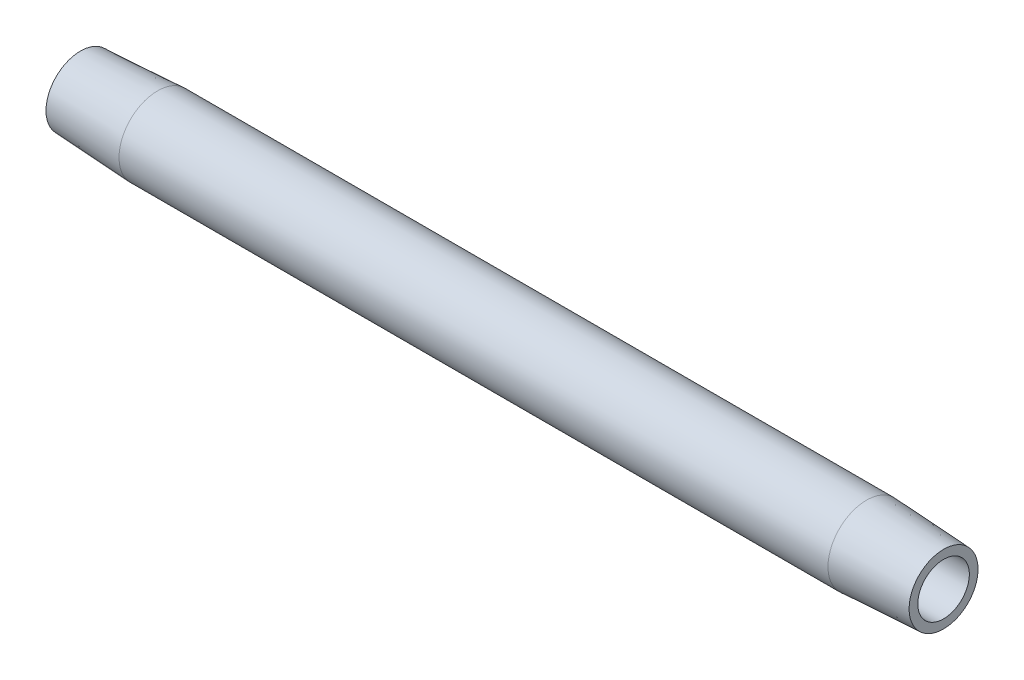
ISO-10303-21;
HEADER;
FILE_DESCRIPTION(('STEP AP214'),'2;1');
FILE_NAME('part.step','',(''),(''),'','','');
FILE_SCHEMA(('AUTOMOTIVE_DESIGN { 1 0 10303 214 1 1 1 1 }'));
ENDSEC;
DATA;
#1=APPLICATION_CONTEXT('core data for automotive mechanical design processes');
#2=APPLICATION_PROTOCOL_DEFINITION('international standard','automotive_design',2000,#1);
#3=PRODUCT_CONTEXT('',#1,'mechanical');
#4=PRODUCT('Part','Part','',(#3));
#5=PRODUCT_RELATED_PRODUCT_CATEGORY('part','',(#4));
#6=PRODUCT_DEFINITION_FORMATION('','',#4);
#7=PRODUCT_DEFINITION_CONTEXT('part definition',#1,'design');
#8=PRODUCT_DEFINITION('design','',#6,#7);
#9=PRODUCT_DEFINITION_SHAPE('','',#8);
#10=(LENGTH_UNIT() NAMED_UNIT(*) SI_UNIT(.MILLI.,.METRE.));
#11=(NAMED_UNIT(*) PLANE_ANGLE_UNIT() SI_UNIT($,.RADIAN.));
#12=(NAMED_UNIT(*) SI_UNIT($,.STERADIAN.) SOLID_ANGLE_UNIT());
#13=UNCERTAINTY_MEASURE_WITH_UNIT(LENGTH_MEASURE(1.E-05),#10,'distance_accuracy_value','');
#14=(GEOMETRIC_REPRESENTATION_CONTEXT(3) GLOBAL_UNCERTAINTY_ASSIGNED_CONTEXT((#13)) GLOBAL_UNIT_ASSIGNED_CONTEXT((#10,
#11,#12)) REPRESENTATION_CONTEXT('',''));
#15=CARTESIAN_POINT('',(0.,0.,0.));
#16=DIRECTION('',(0.,0.,1.));
#17=DIRECTION('',(1.,0.,0.));
#18=AXIS2_PLACEMENT_3D('',#15,#16,#17);
#19=CARTESIAN_POINT('',(0.476141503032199,0.,0.));
#20=DIRECTION('',(-1.,0.,0.));
#21=DIRECTION('',(0.,0.,1.));
#22=AXIS2_PLACEMENT_3D('',#19,#20,#21);
#23=CYLINDRICAL_SURFACE('',#22,3.96875);
#24=CARTESIAN_POINT('',(7.9375,0.,0.));
#25=DIRECTION('',(-1.,0.,0.));
#26=DIRECTION('',(0.,0.,1.));
#27=AXIS2_PLACEMENT_3D('',#24,#25,#26);
#28=CIRCLE('',#27,3.96875);
#29=CARTESIAN_POINT('',(7.9375,0.,3.96875));
#30=VERTEX_POINT('',#29);
#31=EDGE_CURVE('E10',#30,#30,#28,.T.);
#32=ORIENTED_EDGE('',*,*,#31,.F.);
#33=EDGE_LOOP('',(#32));
#34=FACE_BOUND('',#33,.T.);
#35=CARTESIAN_POINT('',(80.9625,0.,0.));
#36=DIRECTION('',(-1.,0.,0.));
#37=DIRECTION('',(0.,0.,1.));
#38=AXIS2_PLACEMENT_3D('',#35,#36,#37);
#39=CIRCLE('',#38,3.96875);
#40=CARTESIAN_POINT('',(80.9625,0.,3.96875));
#41=VERTEX_POINT('',#40);
#42=EDGE_CURVE('E52',#41,#41,#39,.T.);
#43=ORIENTED_EDGE('',*,*,#42,.T.);
#44=EDGE_LOOP('',(#43));
#45=FACE_BOUND('',#44,.T.);
#46=ADVANCED_FACE('F30',(#34,#45),#23,.T.);
#47=CARTESIAN_POINT('',(7.9375,0.,0.));
#48=DIRECTION('',(1.,0.,0.));
#49=DIRECTION('',(0.,0.,-1.));
#50=AXIS2_PLACEMENT_3D('',#47,#48,#49);
#51=CONICAL_SURFACE('',#50,3.96875,0.0523598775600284);
#52=CARTESIAN_POINT('',(0.,0.,0.));
#53=DIRECTION('',(-1.,0.,0.));
#54=DIRECTION('',(0.,0.,1.));
#55=AXIS2_PLACEMENT_3D('',#52,#53,#54);
#56=CIRCLE('',#55,3.55276325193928);
#57=CARTESIAN_POINT('',(0.,0.,3.55276325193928));
#58=VERTEX_POINT('',#57);
#59=EDGE_CURVE('E36',#58,#58,#56,.T.);
#60=ORIENTED_EDGE('',*,*,#59,.F.);
#61=EDGE_LOOP('',(#60));
#62=FACE_BOUND('',#61,.T.);
#63=ORIENTED_EDGE('',*,*,#31,.T.);
#64=EDGE_LOOP('',(#63));
#65=FACE_BOUND('',#64,.T.);
#66=ADVANCED_FACE('F77',(#62,#65),#51,.T.);
#67=CARTESIAN_POINT('',(0.,3.55276325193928,0.));
#68=DIRECTION('',(1.,0.,0.));
#69=DIRECTION('',(0.,0.,-1.));
#70=AXIS2_PLACEMENT_3D('',#67,#68,#69);
#71=PLANE('',#70);
#72=CARTESIAN_POINT('',(0.,0.,0.));
#73=DIRECTION('',(-1.,0.,0.));
#74=DIRECTION('',(0.,0.,1.));
#75=AXIS2_PLACEMENT_3D('',#72,#73,#74);
#76=CIRCLE('',#75,2.65429999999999);
#77=CARTESIAN_POINT('',(0.,0.,2.65429999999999));
#78=VERTEX_POINT('',#77);
#79=EDGE_CURVE('E40',#78,#78,#76,.T.);
#80=ORIENTED_EDGE('',*,*,#79,.F.);
#81=EDGE_LOOP('',(#80));
#82=FACE_BOUND('',#81,.T.);
#83=ORIENTED_EDGE('',*,*,#59,.T.);
#84=EDGE_LOOP('',(#83));
#85=FACE_BOUND('',#84,.T.);
#86=ADVANCED_FACE('F72',(#82,#85),#71,.F.);
#87=CARTESIAN_POINT('',(0.476141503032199,0.,0.));
#88=DIRECTION('',(-1.,0.,0.));
#89=DIRECTION('',(0.,0.,1.));
#90=AXIS2_PLACEMENT_3D('',#87,#88,#89);
#91=CYLINDRICAL_SURFACE('',#90,2.6543);
#92=CARTESIAN_POINT('',(88.9,0.,0.));
#93=DIRECTION('',(-1.,0.,0.));
#94=DIRECTION('',(0.,0.,1.));
#95=AXIS2_PLACEMENT_3D('',#92,#93,#94);
#96=CIRCLE('',#95,2.6543);
#97=CARTESIAN_POINT('',(88.9,0.,2.6543));
#98=VERTEX_POINT('',#97);
#99=EDGE_CURVE('E44',#98,#98,#96,.T.);
#100=ORIENTED_EDGE('',*,*,#99,.F.);
#101=EDGE_LOOP('',(#100));
#102=FACE_BOUND('',#101,.T.);
#103=ORIENTED_EDGE('',*,*,#79,.T.);
#104=EDGE_LOOP('',(#103));
#105=FACE_BOUND('',#104,.T.);
#106=ADVANCED_FACE('F66',(#102,#105),#91,.F.);
#107=CARTESIAN_POINT('',(88.9,2.6543,0.));
#108=DIRECTION('',(-1.,0.,0.));
#109=DIRECTION('',(0.,0.,1.));
#110=AXIS2_PLACEMENT_3D('',#107,#108,#109);
#111=PLANE('',#110);
#112=CARTESIAN_POINT('',(88.9,0.,0.));
#113=DIRECTION('',(-1.,0.,0.));
#114=DIRECTION('',(0.,0.,1.));
#115=AXIS2_PLACEMENT_3D('',#112,#113,#114);
#116=CIRCLE('',#115,3.55276325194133);
#117=CARTESIAN_POINT('',(88.9,0.,3.55276325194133));
#118=VERTEX_POINT('',#117);
#119=EDGE_CURVE('E49',#118,#118,#116,.T.);
#120=ORIENTED_EDGE('',*,*,#119,.F.);
#121=EDGE_LOOP('',(#120));
#122=FACE_BOUND('',#121,.T.);
#123=ORIENTED_EDGE('',*,*,#99,.T.);
#124=EDGE_LOOP('',(#123));
#125=FACE_BOUND('',#124,.T.);
#126=ADVANCED_FACE('F60',(#122,#125),#111,.F.);
#127=CARTESIAN_POINT('',(88.9,0.,0.));
#128=DIRECTION('',(-1.,0.,0.));
#129=DIRECTION('',(0.,0.,1.));
#130=AXIS2_PLACEMENT_3D('',#127,#128,#129);
#131=CONICAL_SURFACE('',#130,3.55276325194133,0.0523598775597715);
#132=ORIENTED_EDGE('',*,*,#42,.F.);
#133=EDGE_LOOP('',(#132));
#134=FACE_BOUND('',#133,.T.);
#135=ORIENTED_EDGE('',*,*,#119,.T.);
#136=EDGE_LOOP('',(#135));
#137=FACE_BOUND('',#136,.T.);
#138=ADVANCED_FACE('F57',(#134,#137),#131,.T.);
#139=CLOSED_SHELL('',(#46,#66,#86,#106,#126,#138));
#140=MANIFOLD_SOLID_BREP('B2',#139);
#141=ADVANCED_BREP_SHAPE_REPRESENTATION('',(#18,#140),#14);
#142=SHAPE_DEFINITION_REPRESENTATION(#9,#141);
ENDSEC;
END-ISO-10303-21;
